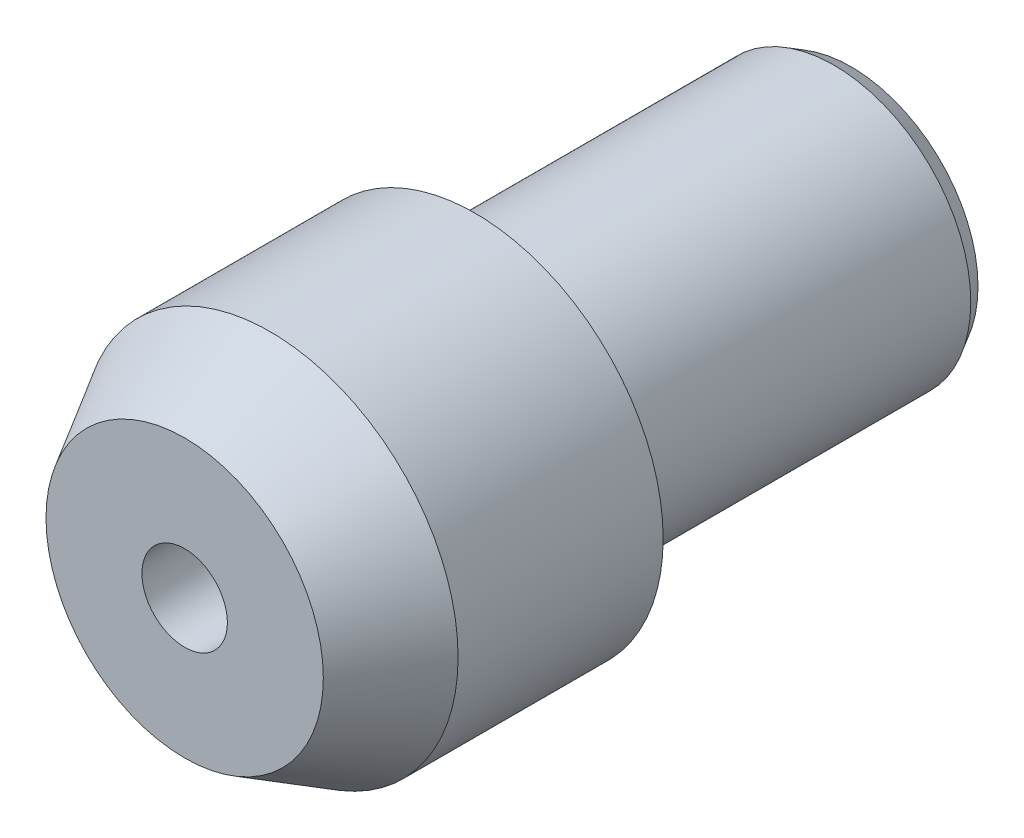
ISO-10303-21;
HEADER;
FILE_DESCRIPTION(('STEP AP214'),'2;1');
FILE_NAME('part.step','',(''),(''),'','','');
FILE_SCHEMA(('AUTOMOTIVE_DESIGN { 1 0 10303 214 1 1 1 1 }'));
ENDSEC;
DATA;
#1=APPLICATION_CONTEXT('core data for automotive mechanical design processes');
#2=APPLICATION_PROTOCOL_DEFINITION('international standard','automotive_design',2000,#1);
#3=PRODUCT_CONTEXT('',#1,'mechanical');
#4=PRODUCT('Part','Part','',(#3));
#5=PRODUCT_RELATED_PRODUCT_CATEGORY('part','',(#4));
#6=PRODUCT_DEFINITION_FORMATION('','',#4);
#7=PRODUCT_DEFINITION_CONTEXT('part definition',#1,'design');
#8=PRODUCT_DEFINITION('design','',#6,#7);
#9=PRODUCT_DEFINITION_SHAPE('','',#8);
#10=(LENGTH_UNIT() NAMED_UNIT(*) SI_UNIT(.MILLI.,.METRE.));
#11=(NAMED_UNIT(*) PLANE_ANGLE_UNIT() SI_UNIT($,.RADIAN.));
#12=(NAMED_UNIT(*) SI_UNIT($,.STERADIAN.) SOLID_ANGLE_UNIT());
#13=UNCERTAINTY_MEASURE_WITH_UNIT(LENGTH_MEASURE(1.E-05),#10,'distance_accuracy_value','');
#14=(GEOMETRIC_REPRESENTATION_CONTEXT(3) GLOBAL_UNCERTAINTY_ASSIGNED_CONTEXT((#13)) GLOBAL_UNIT_ASSIGNED_CONTEXT((#10,
#11,#12)) REPRESENTATION_CONTEXT('',''));
#15=CARTESIAN_POINT('',(0.,0.,0.));
#16=DIRECTION('',(0.,0.,1.));
#17=DIRECTION('',(1.,0.,0.));
#18=AXIS2_PLACEMENT_3D('',#15,#16,#17);
#19=CARTESIAN_POINT('',(0.,0.,-21.));
#20=DIRECTION('',(0.,0.,1.));
#21=DIRECTION('',(1.,0.,0.));
#22=AXIS2_PLACEMENT_3D('',#19,#20,#21);
#23=CONICAL_SURFACE('',#22,8.,0.523598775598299);
#24=CARTESIAN_POINT('',(0.,0.,-22.));
#25=DIRECTION('',(0.,0.,1.));
#26=DIRECTION('',(1.,0.,0.));
#27=AXIS2_PLACEMENT_3D('',#24,#25,#26);
#28=CIRCLE('',#27,7.42264973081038);
#29=CARTESIAN_POINT('',(7.42264973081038,0.,-22.));
#30=VERTEX_POINT('',#29);
#31=EDGE_CURVE('E43',#30,#30,#28,.T.);
#32=ORIENTED_EDGE('',*,*,#31,.T.);
#33=EDGE_LOOP('',(#32));
#34=FACE_BOUND('',#33,.T.);
#35=CARTESIAN_POINT('',(0.,0.,-21.));
#36=DIRECTION('',(0.,0.,1.));
#37=DIRECTION('',(1.,0.,0.));
#38=AXIS2_PLACEMENT_3D('',#35,#36,#37);
#39=CIRCLE('',#38,8.);
#40=CARTESIAN_POINT('',(8.,0.,-21.));
#41=VERTEX_POINT('',#40);
#42=EDGE_CURVE('E8',#41,#41,#39,.T.);
#43=ORIENTED_EDGE('',*,*,#42,.F.);
#44=EDGE_LOOP('',(#43));
#45=FACE_BOUND('',#44,.T.);
#46=ADVANCED_FACE('F12',(#34,#45),#23,.T.);
#47=CARTESIAN_POINT('',(0.,0.,20.));
#48=DIRECTION('',(0.,0.,1.));
#49=DIRECTION('',(1.,0.,0.));
#50=AXIS2_PLACEMENT_3D('',#47,#48,#49);
#51=CYLINDRICAL_SURFACE('',#50,8.);
#52=ORIENTED_EDGE('',*,*,#42,.T.);
#53=EDGE_LOOP('',(#52));
#54=FACE_BOUND('',#53,.T.);
#55=CARTESIAN_POINT('',(0.,0.,0.));
#56=DIRECTION('',(0.,0.,1.));
#57=DIRECTION('',(1.,0.,0.));
#58=AXIS2_PLACEMENT_3D('',#55,#56,#57);
#59=CIRCLE('',#58,8.);
#60=CARTESIAN_POINT('',(8.,0.,0.));
#61=VERTEX_POINT('',#60);
#62=EDGE_CURVE('E18',#61,#61,#59,.T.);
#63=ORIENTED_EDGE('',*,*,#62,.F.);
#64=EDGE_LOOP('',(#63));
#65=FACE_BOUND('',#64,.T.);
#66=ADVANCED_FACE('F72',(#54,#65),#51,.T.);
#67=CARTESIAN_POINT('',(8.,0.,0.));
#68=DIRECTION('',(0.,0.,1.));
#69=DIRECTION('',(1.,0.,0.));
#70=AXIS2_PLACEMENT_3D('',#67,#68,#69);
#71=PLANE('',#70);
#72=CARTESIAN_POINT('',(0.,0.,0.));
#73=DIRECTION('',(0.,0.,1.));
#74=DIRECTION('',(1.,0.,0.));
#75=AXIS2_PLACEMENT_3D('',#72,#73,#74);
#76=CIRCLE('',#75,11.);
#77=CARTESIAN_POINT('',(11.,0.,0.));
#78=VERTEX_POINT('',#77);
#79=EDGE_CURVE('E22',#78,#78,#76,.T.);
#80=ORIENTED_EDGE('',*,*,#79,.F.);
#81=EDGE_LOOP('',(#80));
#82=FACE_BOUND('',#81,.T.);
#83=ORIENTED_EDGE('',*,*,#62,.T.);
#84=EDGE_LOOP('',(#83));
#85=FACE_BOUND('',#84,.T.);
#86=ADVANCED_FACE('F77',(#82,#85),#71,.F.);
#87=CARTESIAN_POINT('',(0.,0.,20.));
#88=DIRECTION('',(0.,0.,1.));
#89=DIRECTION('',(1.,0.,0.));
#90=AXIS2_PLACEMENT_3D('',#87,#88,#89);
#91=CYLINDRICAL_SURFACE('',#90,11.);
#92=ORIENTED_EDGE('',*,*,#79,.T.);
#93=EDGE_LOOP('',(#92));
#94=FACE_BOUND('',#93,.T.);
#95=CARTESIAN_POINT('',(0.,0.,12.));
#96=DIRECTION('',(0.,0.,1.));
#97=DIRECTION('',(1.,0.,0.));
#98=AXIS2_PLACEMENT_3D('',#95,#96,#97);
#99=CIRCLE('',#98,11.);
#100=CARTESIAN_POINT('',(11.,0.,12.));
#101=VERTEX_POINT('',#100);
#102=EDGE_CURVE('E26',#101,#101,#99,.T.);
#103=ORIENTED_EDGE('',*,*,#102,.F.);
#104=EDGE_LOOP('',(#103));
#105=FACE_BOUND('',#104,.T.);
#106=ADVANCED_FACE('F68',(#94,#105),#91,.T.);
#107=CARTESIAN_POINT('',(0.,0.,12.));
#108=DIRECTION('',(0.,0.,-1.));
#109=DIRECTION('',(-1.,0.,0.));
#110=AXIS2_PLACEMENT_3D('',#107,#108,#109);
#111=CONICAL_SURFACE('',#110,11.,0.523598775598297);
#112=CARTESIAN_POINT('',(0.,0.,17.));
#113=DIRECTION('',(0.,0.,1.));
#114=DIRECTION('',(1.,0.,0.));
#115=AXIS2_PLACEMENT_3D('',#112,#113,#114);
#116=CIRCLE('',#115,8.11324865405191);
#117=CARTESIAN_POINT('',(8.11324865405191,0.,17.));
#118=VERTEX_POINT('',#117);
#119=EDGE_CURVE('E31',#118,#118,#116,.T.);
#120=ORIENTED_EDGE('',*,*,#119,.F.);
#121=EDGE_LOOP('',(#120));
#122=FACE_BOUND('',#121,.T.);
#123=ORIENTED_EDGE('',*,*,#102,.T.);
#124=EDGE_LOOP('',(#123));
#125=FACE_BOUND('',#124,.T.);
#126=ADVANCED_FACE('F61',(#122,#125),#111,.T.);
#127=CARTESIAN_POINT('',(2.5,0.,17.));
#128=DIRECTION('',(0.,0.,1.));
#129=DIRECTION('',(1.,0.,0.));
#130=AXIS2_PLACEMENT_3D('',#127,#128,#129);
#131=PLANE('',#130);
#132=ORIENTED_EDGE('',*,*,#119,.T.);
#133=EDGE_LOOP('',(#132));
#134=FACE_BOUND('',#133,.T.);
#135=CARTESIAN_POINT('',(0.,0.,17.));
#136=DIRECTION('',(0.,0.,1.));
#137=DIRECTION('',(1.,0.,0.));
#138=AXIS2_PLACEMENT_3D('',#135,#136,#137);
#139=CIRCLE('',#138,2.5);
#140=CARTESIAN_POINT('',(2.5,0.,17.));
#141=VERTEX_POINT('',#140);
#142=EDGE_CURVE('E34',#141,#141,#139,.T.);
#143=ORIENTED_EDGE('',*,*,#142,.F.);
#144=EDGE_LOOP('',(#143));
#145=FACE_BOUND('',#144,.T.);
#146=ADVANCED_FACE('F56',(#134,#145),#131,.T.);
#147=CARTESIAN_POINT('',(0.,0.,20.));
#148=DIRECTION('',(0.,0.,1.));
#149=DIRECTION('',(1.,0.,0.));
#150=AXIS2_PLACEMENT_3D('',#147,#148,#149);
#151=CYLINDRICAL_SURFACE('',#150,2.5);
#152=CARTESIAN_POINT('',(0.,0.,9.));
#153=DIRECTION('',(0.,0.,1.));
#154=DIRECTION('',(1.,0.,0.));
#155=AXIS2_PLACEMENT_3D('',#152,#153,#154);
#156=CIRCLE('',#155,2.5);
#157=CARTESIAN_POINT('',(2.5,0.,9.));
#158=VERTEX_POINT('',#157);
#159=EDGE_CURVE('E46',#158,#158,#156,.T.);
#160=ORIENTED_EDGE('',*,*,#159,.F.);
#161=EDGE_LOOP('',(#160));
#162=FACE_BOUND('',#161,.T.);
#163=ORIENTED_EDGE('',*,*,#142,.T.);
#164=EDGE_LOOP('',(#163));
#165=FACE_BOUND('',#164,.T.);
#166=ADVANCED_FACE('F52',(#162,#165),#151,.F.);
#167=CARTESIAN_POINT('',(0.,0.,-18.));
#168=DIRECTION('',(0.,0.,1.));
#169=DIRECTION('',(1.,0.,0.));
#170=AXIS2_PLACEMENT_3D('',#167,#168,#169);
#171=PLANE('',#170);
#172=CARTESIAN_POINT('',(0.,0.,-18.));
#173=DIRECTION('',(0.,0.,1.));
#174=DIRECTION('',(1.,0.,0.));
#175=AXIS2_PLACEMENT_3D('',#172,#173,#174);
#176=CIRCLE('',#175,1.);
#177=CARTESIAN_POINT('',(1.,0.,-18.));
#178=VERTEX_POINT('',#177);
#179=EDGE_CURVE('E37',#178,#178,#176,.T.);
#180=ORIENTED_EDGE('',*,*,#179,.F.);
#181=EDGE_LOOP('',(#180));
#182=FACE_BOUND('',#181,.T.);
#183=ADVANCED_FACE('F55',(#182),#171,.F.);
#184=CARTESIAN_POINT('',(0.,0.,20.));
#185=DIRECTION('',(0.,0.,1.));
#186=DIRECTION('',(1.,0.,0.));
#187=AXIS2_PLACEMENT_3D('',#184,#185,#186);
#188=CYLINDRICAL_SURFACE('',#187,1.);
#189=CARTESIAN_POINT('',(0.,0.,-22.));
#190=DIRECTION('',(0.,0.,1.));
#191=DIRECTION('',(1.,0.,0.));
#192=AXIS2_PLACEMENT_3D('',#189,#190,#191);
#193=CIRCLE('',#192,1.);
#194=CARTESIAN_POINT('',(1.,0.,-22.));
#195=VERTEX_POINT('',#194);
#196=EDGE_CURVE('E40',#195,#195,#193,.T.);
#197=ORIENTED_EDGE('',*,*,#196,.F.);
#198=EDGE_LOOP('',(#197));
#199=FACE_BOUND('',#198,.T.);
#200=ORIENTED_EDGE('',*,*,#179,.T.);
#201=EDGE_LOOP('',(#200));
#202=FACE_BOUND('',#201,.T.);
#203=ADVANCED_FACE('F84',(#199,#202),#188,.F.);
#204=CARTESIAN_POINT('',(1.,0.,-22.));
#205=DIRECTION('',(0.,0.,1.));
#206=DIRECTION('',(1.,0.,0.));
#207=AXIS2_PLACEMENT_3D('',#204,#205,#206);
#208=PLANE('',#207);
#209=ORIENTED_EDGE('',*,*,#31,.F.);
#210=EDGE_LOOP('',(#209));
#211=FACE_BOUND('',#210,.T.);
#212=ORIENTED_EDGE('',*,*,#196,.T.);
#213=EDGE_LOOP('',(#212));
#214=FACE_BOUND('',#213,.T.);
#215=ADVANCED_FACE('F81',(#211,#214),#208,.F.);
#216=CARTESIAN_POINT('',(0.,0.,9.));
#217=DIRECTION('',(0.,0.,1.));
#218=DIRECTION('',(1.,0.,0.));
#219=AXIS2_PLACEMENT_3D('',#216,#217,#218);
#220=PLANE('',#219);
#221=ORIENTED_EDGE('',*,*,#159,.T.);
#222=EDGE_LOOP('',(#221));
#223=FACE_BOUND('',#222,.T.);
#224=ADVANCED_FACE('F50',(#223),#220,.T.);
#225=CLOSED_SHELL('',(#46,#66,#86,#106,#126,#146,#166,#183,#203,#215,#224));
#226=MANIFOLD_SOLID_BREP('B1',#225);
#227=ADVANCED_BREP_SHAPE_REPRESENTATION('',(#18,#226),#14);
#228=SHAPE_DEFINITION_REPRESENTATION(#9,#227);
ENDSEC;
END-ISO-10303-21;
